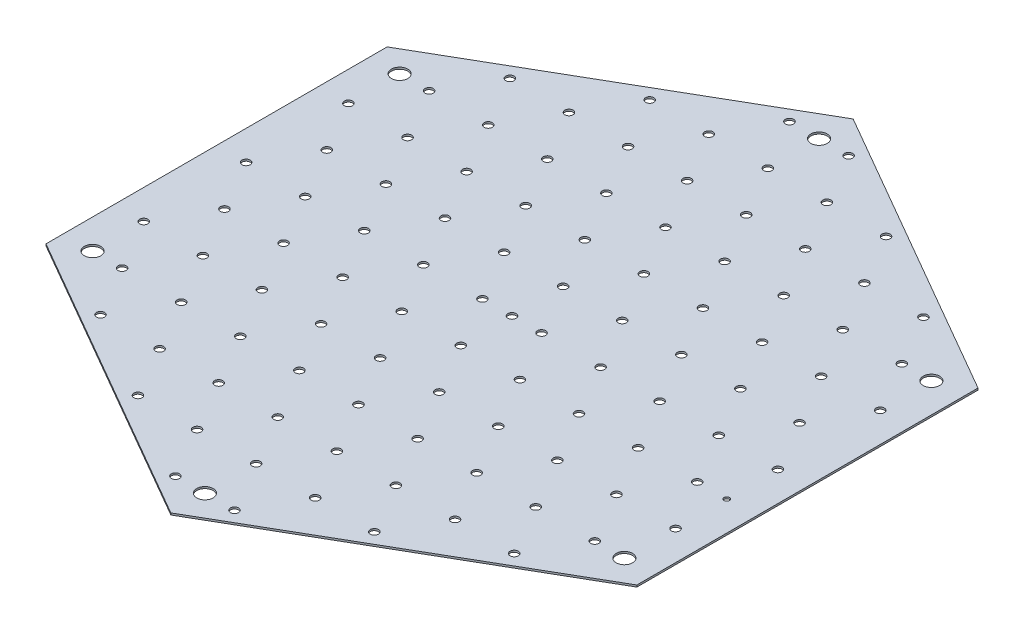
from build123d import *

# Parameters (mm, degrees)
BOSS_EXTRUDE1_DEPTH   = 0.34
SKETCH2_R             = 0.75
CUT_EXTRUDE1_DEPTH    = 83.680427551
BOSS_EXTRUDE2_DEPTH   = 0.34
BOSS_EXTRUDE3_DEPTH   = 0.34
BOSS_EXTRUDE4_DEPTH   = 0.34
SKETCH4_R             = 1.5
CUT_EXTRUDE3_DEPTH    = 83.680427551
SKETCH8_R             = 0.75
CUT_EXTRUDE4_DEPTH    = 83.680427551
SKETCH9_R             = 0.75
CUT_EXTRUDE5_DEPTH    = 83.680427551
SKETCH10_R            = 0.75
CUT_EXTRUDE6_DEPTH    = 83.680427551
SKETCH11_R            = 0.75
CUT_EXTRUDE7_DEPTH    = 83.680427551
SKETCH12_R            = 0.75
CUT_EXTRUDE8_DEPTH    = 83.680427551
SKETCH13_R            = 0.75
CUT_EXTRUDE9_DEPTH    = 83.680427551
SKETCH14_R            = 0.75
CUT_EXTRUDE10_DEPTH   = 83.680427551
SKETCH15_R            = 0.75
CUT_EXTRUDE11_DEPTH   = 83.680427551
SKETCH16_R            = 0.75
CUT_EXTRUDE12_DEPTH   = 83.680427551
SKETCH17_R            = 0.75
CUT_EXTRUDE13_DEPTH   = 83.680427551
LPATTERN3_COUNT       = 5
LPATTERN3_PITCH       = 10.8253
LPATTERN3_COL_COUNT   = 6
LPATTERN3_COL_PITCH   = 10.8253
LPATTERN4_COUNT       = 6
LPATTERN4_PITCH       = 10.8253
LPATTERN4_COL_COUNT   = 5
LPATTERN4_COL_PITCH   = 10.8253
LPATTERN5_COUNT       = 4
LPATTERN5_PITCH       = 10.8253
LPATTERN5_COL_COUNT   = 7
LPATTERN5_COL_PITCH   = 10.8253
LPATTERN6_COUNT       = 3
LPATTERN6_PITCH       = 10.8253
LPATTERN6_COL_COUNT   = 7
LPATTERN6_COL_PITCH   = 10.8253
LPATTERN7_COUNT       = 6
LPATTERN7_PITCH       = 10.8253
LPATTERN8_COUNT       = 5
LPATTERN8_PITCH       = 10.8253
LPATTERN9_COUNT       = 5
LPATTERN9_PITCH       = 10.8253
LPATTERN9_COL_COUNT   = 2
LPATTERN9_COL_PITCH   = 10.8253
LPATTERN10_COUNT      = 4
LPATTERN10_PITCH      = 10.8253
LPATTERN10_COL_COUNT  = 3
LPATTERN10_COL_PITCH  = 10.8253
LPATTERN11_COUNT      = 4
LPATTERN11_PITCH      = 10.8253
LPATTERN11_COL_COUNT  = 3
LPATTERN11_COL_PITCH  = 10.8253
LPATTERN12_COUNT      = 5
LPATTERN12_PITCH      = 10.8253
LPATTERN13_COUNT      = 6
LPATTERN13_PITCH      = 10.8253
LPATTERN14_COUNT      = 6
LPATTERN14_PITCH      = 10.8253
LPATTERN14_COUNT_DIR2 = 5
LPATTERN14_PITCH_DIR2 = 10.8253
LPATTERN15_COUNT      = 7
LPATTERN15_PITCH      = 10.8253
LPATTERN15_COUNT_DIR2 = 4
LPATTERN15_PITCH_DIR2 = 10.8253
LPATTERN16_COUNT      = 7
LPATTERN16_PITCH      = 10.8253
LPATTERN16_COUNT_DIR2 = 3
LPATTERN16_PITCH_DIR2 = 10.8253
LPATTERN17_COUNT      = 6
LPATTERN17_PITCH      = 10.8253
LPATTERN18_COUNT      = 5
LPATTERN18_PITCH      = 10.8253
LPATTERN19_COUNT      = 4
LPATTERN19_PITCH      = 10.8253
LPATTERN20_COUNT      = 3
LPATTERN20_PITCH      = 10.8253
SKETCH18_R            = 0.5
CUT_EXTRUDE14_DEPTH   = 83.680427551


with BuildPart() as part:
    # Sketch1 → Boss-Extrude1 (new body)
    with BuildSketch(Plane(origin=(0, 0, 0), x_dir=(1, 0, 0), z_dir=(0, 1, 0))):
        Polygon((0, 62.5), (-54.126587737, 31.25), (-54.126587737, -31.25), (0, -62.5), (54.126587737, -31.25), (54.126587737, 31.25), align=None)
    extrude(amount=BOSS_EXTRUDE1_DEPTH)

    # Sketch2 → Cut-Extrude1 (cut, through all)
    with BuildSketch(Plane(origin=(0, 0.34, 0), x_dir=(1, 0, 0), z_dir=(0, 1, 0))):
        with Locations(Location((0, 0, 0), (0, 0, 270))):
            Circle(SKETCH2_R)
    extrude(amount=-CUT_EXTRUDE1_DEPTH, mode=Mode.SUBTRACT)

    # Sketch5 → Boss-Extrude2 (add)
    with BuildSketch(Plane(origin=(0, 0.34, 0), x_dir=(1, 0, 0), z_dir=(0, 1, 0))):
        Polygon((-54.126587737, 26.862137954), (3.8, 60.306068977), (0, 62.5), (-54.126587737, 31.25), align=None)
    extrude(amount=-BOSS_EXTRUDE2_DEPTH)

    # Sketch6 → Boss-Extrude3 (add)
    with BuildSketch(Plane(origin=(0, 0.34, 0), x_dir=(1, 0, 0), z_dir=(0, 1, 0))):
        Polygon((54.126587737, 31.25), (54.126587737, 26.862137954), (-3.8, 60.306068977), (0, 62.5), align=None)
    extrude(amount=-BOSS_EXTRUDE3_DEPTH)

    # Sketch7 → Boss-Extrude4 (add)
    with BuildSketch(Plane(origin=(0, 0.34, 0), x_dir=(1, 0, 0), z_dir=(0, 1, 0))):
        Polygon((-54.126587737, -31.25), (-54.126587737, -26.862137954), (0, -58.112137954), (54.126587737, -26.862137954), (54.126587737, -31.25), (0, -62.5), align=None)
    extrude(amount=-BOSS_EXTRUDE4_DEPTH)

    # Sketch4 → Cut-Extrude3 (cut, through all)
    with BuildSketch(Plane(origin=(0, 0.34, 0), x_dir=(1, 0, 0), z_dir=(0, 1, 0))):
        with Locations(Location((0, 56.253070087, 0), (0, 0, 270))):
            Circle(SKETCH4_R)
        with Locations(Location((-48.713928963, 28.125, 0), (0, 0, 270))):
            Circle(SKETCH4_R)
        with Locations(Location((-48.716587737, -28.126535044, 0), (0, 0, 270))):
            Circle(SKETCH4_R)
        with Locations(Location((0, -56.253070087, 0), (0, 0, 270))):
            Circle(SKETCH4_R)
        with Locations(Location((48.716587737, -28.126535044, 0), (0, 0, 270))):
            Circle(SKETCH4_R)
        with Locations(Location((48.716587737, 28.126535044, 0), (0, 0, 270))):
            Circle(SKETCH4_R)
    extrude(amount=-CUT_EXTRUDE3_DEPTH, mode=Mode.SUBTRACT)

    # Sketch8 → Cut-Extrude4 (cut, through all)
    with BuildSketch(Plane(origin=(0, 0.34, 0), x_dir=(1, 0, 0), z_dir=(0, 1, 0))):
        with Locations(Location((5.41265, 0, 0), (0, 0, 270))):
            Circle(SKETCH8_R)
    cut_extrude4 = extrude(amount=-CUT_EXTRUDE4_DEPTH, mode=Mode.SUBTRACT)

    # Sketch9 → Cut-Extrude5 (cut, through all)
    with BuildSketch(Plane(origin=(0, 0.34, 0), x_dir=(1, 0, 0), z_dir=(0, 1, 0))):
        with Locations(Location((16.23795, 0, 0), (0, 0, 270))):
            Circle(SKETCH9_R)
    cut_extrude5 = extrude(amount=-CUT_EXTRUDE5_DEPTH, mode=Mode.SUBTRACT)

    # Sketch10 → Cut-Extrude6 (cut, through all)
    with BuildSketch(Plane(origin=(0, 0.34, 0), x_dir=(1, 0, 0), z_dir=(0, 1, 0))):
        with Locations(Location((27.06325, 0, 0), (0, 0, 270))):
            Circle(SKETCH10_R)
    cut_extrude6 = extrude(amount=-CUT_EXTRUDE6_DEPTH, mode=Mode.SUBTRACT)

    # Sketch11 → Cut-Extrude7 (cut, through all)
    with BuildSketch(Plane(origin=(0, 0.34, 0), x_dir=(1, 0, 0), z_dir=(0, 1, 0))):
        with Locations(Location((37.88855, 0, 0), (0, 0, 270))):
            Circle(SKETCH11_R)
    cut_extrude7 = extrude(amount=-CUT_EXTRUDE7_DEPTH, mode=Mode.SUBTRACT)

    # Sketch12 → Cut-Extrude8 (cut, through all)
    with BuildSketch(Plane(origin=(0, 0.34, 0), x_dir=(1, 0, 0), z_dir=(0, 1, 0))):
        with Locations(Location((48.71385, 0, 0), (0, 0, 270))):
            Circle(SKETCH12_R)
    cut_extrude8 = extrude(amount=-CUT_EXTRUDE8_DEPTH, mode=Mode.SUBTRACT)

    # Sketch13 → Cut-Extrude9 (cut, through all)
    with BuildSketch(Plane(origin=(0, 0.34, 0), x_dir=(1, 0, 0), z_dir=(0, 1, 0))):
        with Locations(Location((-5.41265, 0, 0), (0, 0, 270))):
            Circle(SKETCH13_R)
    cut_extrude9 = extrude(amount=-CUT_EXTRUDE9_DEPTH, mode=Mode.SUBTRACT)

    # Sketch14 → Cut-Extrude10 (cut, through all)
    with BuildSketch(Plane(origin=(0, 0.34, 0), x_dir=(1, 0, 0), z_dir=(0, 1, 0))):
        with Locations(Location((-16.23795, 0, 0), (0, 0, 270))):
            Circle(SKETCH14_R)
    cut_extrude10 = extrude(amount=-CUT_EXTRUDE10_DEPTH, mode=Mode.SUBTRACT)

    # Sketch15 → Cut-Extrude11 (cut, through all)
    with BuildSketch(Plane(origin=(0, 0.34, 0), x_dir=(1, 0, 0), z_dir=(0, 1, 0))):
        with Locations(Location((-27.06325, 0, 0), (0, 0, 270))):
            Circle(SKETCH15_R)
    cut_extrude11 = extrude(amount=-CUT_EXTRUDE11_DEPTH, mode=Mode.SUBTRACT)

    # Sketch16 → Cut-Extrude12 (cut, through all)
    with BuildSketch(Plane(origin=(0, 0.34, 0), x_dir=(1, 0, 0), z_dir=(0, 1, 0))):
        with Locations(Location((-37.88855, 0, 0), (0, 0, 270))):
            Circle(SKETCH16_R)
    cut_extrude12 = extrude(amount=-CUT_EXTRUDE12_DEPTH, mode=Mode.SUBTRACT)

    # Sketch17 → Cut-Extrude13 (cut, through all)
    with BuildSketch(Plane(origin=(0, 0.34, 0), x_dir=(1, 0, 0), z_dir=(0, 1, 0))):
        with Locations(Location((-48.71385, 0, 0), (0, 0, 270))):
            Circle(SKETCH17_R)
    cut_extrude13 = extrude(amount=-CUT_EXTRUDE13_DEPTH, mode=Mode.SUBTRACT)

    # LPattern3: Cut-Extrude4 ×5
    with Locations(*[Vector(0.4999999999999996, 0, 0.8660254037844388) * (i * LPATTERN3_PITCH) for i in range(1, LPATTERN3_COUNT)]):
        add(cut_extrude4, mode=Mode.SUBTRACT)

    # LPattern3 col: Cut-Extrude4 ×6
    with Locations(*[Vector(-0.4999999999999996, 0, -0.8660254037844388) * (i * LPATTERN3_COL_PITCH) for i in range(1, LPATTERN3_COL_COUNT)]):
        add(cut_extrude4, mode=Mode.SUBTRACT)

    # LPattern4: Cut-Extrude5 ×6
    with Locations(*[Vector(-0.4999999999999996, 0, -0.8660254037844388) * (i * LPATTERN4_PITCH) for i in range(1, LPATTERN4_COUNT)]):
        add(cut_extrude5, mode=Mode.SUBTRACT)

    # LPattern4 col: Cut-Extrude5 ×5
    with Locations(*[Vector(0.4999999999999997, 0, 0.8660254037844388) * (i * LPATTERN4_COL_PITCH) for i in range(1, LPATTERN4_COL_COUNT)]):
        add(cut_extrude5, mode=Mode.SUBTRACT)

    # LPattern5: Cut-Extrude6 ×4
    with Locations(*[Vector(0.4999999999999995, 0, 0.8660254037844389) * (i * LPATTERN5_PITCH) for i in range(1, LPATTERN5_COUNT)]):
        add(cut_extrude6, mode=Mode.SUBTRACT)

    # LPattern5 col: Cut-Extrude6 ×7
    with Locations(*[Vector(-0.4999999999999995, 0, -0.8660254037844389) * (i * LPATTERN5_COL_PITCH) for i in range(1, LPATTERN5_COL_COUNT)]):
        add(cut_extrude6, mode=Mode.SUBTRACT)

    # LPattern6: Cut-Extrude7 ×3
    with Locations(*[Vector(0.4999999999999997, 0, 0.8660254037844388) * (i * LPATTERN6_PITCH) for i in range(1, LPATTERN6_COUNT)]):
        add(cut_extrude7, mode=Mode.SUBTRACT)

    # LPattern6 col: Cut-Extrude7 ×7
    with Locations(*[Vector(-0.4999999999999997, 0, -0.8660254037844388) * (i * LPATTERN6_COL_PITCH) for i in range(1, LPATTERN6_COL_COUNT)]):
        add(cut_extrude7, mode=Mode.SUBTRACT)

    # LPattern7: Cut-Extrude8 ×6
    with Locations(*[Vector(-0.4999999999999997, 0, -0.8660254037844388) * (i * LPATTERN7_PITCH) for i in range(1, LPATTERN7_COUNT)]):
        add(cut_extrude8, mode=Mode.SUBTRACT)

    # LPattern8: Cut-Extrude9 ×5
    with Locations(*[Vector(-0.4999999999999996, 0, 0.8660254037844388) * (i * LPATTERN8_PITCH) for i in range(1, LPATTERN8_COUNT)]):
        add(cut_extrude9, mode=Mode.SUBTRACT)

    # LPattern9: Cut-Extrude10 ×5
    with Locations(*[Vector(-0.4999999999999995, 0, 0.8660254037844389) * (i * LPATTERN9_PITCH) for i in range(1, LPATTERN9_COUNT)]):
        add(cut_extrude10, mode=Mode.SUBTRACT)

    # LPattern9 col: Cut-Extrude10 ×2
    with Locations(*[Vector(0.4999999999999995, 0, -0.8660254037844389) * (i * LPATTERN9_COL_PITCH) for i in range(1, LPATTERN9_COL_COUNT)]):
        add(cut_extrude10, mode=Mode.SUBTRACT)

    # LPattern10: Cut-Extrude11 ×4
    with Locations(*[Vector(-0.4999999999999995, 0, 0.8660254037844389) * (i * LPATTERN10_PITCH) for i in range(1, LPATTERN10_COUNT)]):
        add(cut_extrude11, mode=Mode.SUBTRACT)

    # LPattern10 col: Cut-Extrude11 ×3
    with Locations(*[Vector(0.4999999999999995, 0, -0.8660254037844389) * (i * LPATTERN10_COL_PITCH) for i in range(1, LPATTERN10_COL_COUNT)]):
        add(cut_extrude11, mode=Mode.SUBTRACT)

    # LPattern11: Cut-Extrude12 ×4
    with Locations(*[Vector(0.4999999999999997, 0, -0.8660254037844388) * (i * LPATTERN11_PITCH) for i in range(1, LPATTERN11_COUNT)]):
        add(cut_extrude12, mode=Mode.SUBTRACT)

    # LPattern11 col: Cut-Extrude12 ×3
    with Locations(*[Vector(-0.4999999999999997, 0, 0.8660254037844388) * (i * LPATTERN11_COL_PITCH) for i in range(1, LPATTERN11_COL_COUNT)]):
        add(cut_extrude12, mode=Mode.SUBTRACT)

    # LPattern12: Cut-Extrude13 ×5
    with Locations(*[Vector(0.4999999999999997, 0, -0.8660254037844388) * (i * LPATTERN12_PITCH) for i in range(1, LPATTERN12_COUNT)]):
        add(cut_extrude13, mode=Mode.SUBTRACT)

    # LPattern13: Cut-Extrude9 ×6
    with Locations(*[Vector(0.4999999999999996, 0, 0.8660254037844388) * (i * LPATTERN13_PITCH) for i in range(1, LPATTERN13_COUNT)]):
        add(cut_extrude9, mode=Mode.SUBTRACT)

    # LPattern14: Cut-Extrude10 6 × 5
    with Locations(*[Vector(0.4999999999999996, 0, 0.8660254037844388) * (i * LPATTERN14_PITCH) + Vector(-0.4999999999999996, 0, -0.8660254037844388) * (j * LPATTERN14_PITCH_DIR2) for i in range(LPATTERN14_COUNT) for j in range(LPATTERN14_COUNT_DIR2) if (i, j) != (0, 0)]):
        add(cut_extrude10, mode=Mode.SUBTRACT)

    # LPattern15: Cut-Extrude11 7 × 4
    with Locations(*[Vector(0.4999999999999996, 0, 0.8660254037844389) * (i * LPATTERN15_PITCH) + Vector(-0.4999999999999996, 0, -0.8660254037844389) * (j * LPATTERN15_PITCH_DIR2) for i in range(LPATTERN15_COUNT) for j in range(LPATTERN15_COUNT_DIR2) if (i, j) != (0, 0)]):
        add(cut_extrude11, mode=Mode.SUBTRACT)

    # LPattern16: Cut-Extrude12 7 × 3
    with Locations(*[Vector(0.4999999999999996, 0, 0.8660254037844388) * (i * LPATTERN16_PITCH) + Vector(-0.4999999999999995, 0, -0.8660254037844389) * (j * LPATTERN16_PITCH_DIR2) for i in range(LPATTERN16_COUNT) for j in range(LPATTERN16_COUNT_DIR2) if (i, j) != (0, 0)]):
        add(cut_extrude12, mode=Mode.SUBTRACT)

    # LPattern17: Cut-Extrude13 ×6
    with Locations(*[Vector(0.49999999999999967, 0, 0.8660254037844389) * (i * LPATTERN17_PITCH) for i in range(1, LPATTERN17_COUNT)]):
        add(cut_extrude13, mode=Mode.SUBTRACT)

    # LPattern18: Cut-Extrude5 ×5
    with Locations(*[Vector(0.4999999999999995, 0, -0.8660254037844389) * (i * LPATTERN18_PITCH) for i in range(1, LPATTERN18_COUNT)]):
        add(cut_extrude5, mode=Mode.SUBTRACT)

    # LPattern19: Cut-Extrude6 ×4
    with Locations(*[Vector(0.4999999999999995, 0, -0.866025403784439) * (i * LPATTERN19_PITCH) for i in range(1, LPATTERN19_COUNT)]):
        add(cut_extrude6, mode=Mode.SUBTRACT)

    # LPattern20: Cut-Extrude7 ×3
    with Locations(*[Vector(0.4999999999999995, 0, -0.8660254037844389) * (i * LPATTERN20_PITCH) for i in range(1, LPATTERN20_COUNT)]):
        add(cut_extrude7, mode=Mode.SUBTRACT)

    # Sketch18 → Cut-Extrude14 (cut, through all)
    with BuildSketch(Plane(origin=(0, 0.34, 0), x_dir=(1, 0, 0), z_dir=(0, 1, 0))):
        with Locations(Location((48.71385, -9.374984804, 0), (0, 0, 270))):
            Circle(SKETCH18_R)
    extrude(amount=-CUT_EXTRUDE14_DEPTH, mode=Mode.SUBTRACT)


solid = part.part
